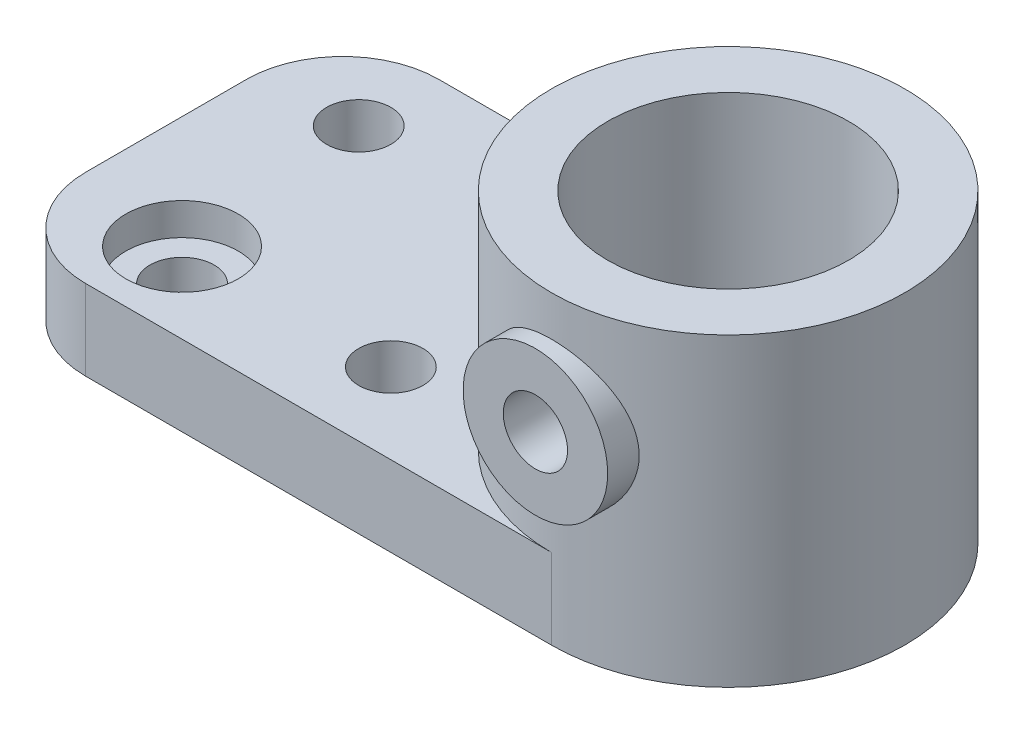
from build123d import *

# Parameters (mm, degrees)
SKETCH_1_R           = 7
SKETCH_1_R_2         = 4
EXTRUDE_1_DEPTH      = 10
SKETCH_2_R           = 22
SKETCH_2_R_2         = 15
EXTRUDE_2_DEPTH      = 28
FILLET_1_R           = 12
SKETCH_3_R           = 7
CUT_EXTRUDE_1_DEPTH  = 4
EXTRUDE_3_REACH      = 93.978
EXTRUDE_3_END_RADIUS = 22
SKETCH_4_R           = 9
SKETCH_5_R           = 4
CUT_EXTRUDE_2_DEPTH  = 13


with BuildPart() as part:
    # Sketch 1 → Extrude 1 (new body)
    with BuildSketch(Plane(origin=(0, 0, 0), x_dir=(1, 0, 0), z_dir=(0, 1, 0))):
        with BuildLine():
            Line((0, 22), (-70, 22))
            Line((-70, 22), (-70, -22))
            Line((-70, -22), (0, -22))
            ThreePointArc((0, -22), (22, 0), (0, 22))
        make_face()
        with Locations(Location((0, 0, 0), (0, 0, 270))):
            Circle(SKETCH_1_R, mode=Mode.SUBTRACT)
        with Locations(Location((-58, 12, 0), (0, 0, 270))):
            Circle(SKETCH_1_R_2, mode=Mode.SUBTRACT)
        with Locations(Location((-32, 12, 0), (0, 0, 270))):
            Circle(SKETCH_1_R_2, mode=Mode.SUBTRACT)
        with Locations(Location((-56, -12, 0), (0, 0, 270))):
            Circle(SKETCH_1_R_2, mode=Mode.SUBTRACT)
        with Locations(Location((-30, -12, 0), (0, 0, 270))):
            Circle(SKETCH_1_R_2, mode=Mode.SUBTRACT)
    extrude(amount=EXTRUDE_1_DEPTH)

    # Sketch 2 → Extrude 2 (add)
    with BuildSketch(Plane(origin=(0, 10, 0), x_dir=(1, 0, 0), z_dir=(0, 1, 0))):
        with Locations(Location((0, 0, 0), (0, 0, 270))):
            Circle(SKETCH_2_R)
        with Locations(Location((0, 0, 0), (0, 0, 270))):
            Circle(SKETCH_2_R_2, mode=Mode.SUBTRACT)
    extrude(amount=EXTRUDE_2_DEPTH)

    # Fillet 1
    fillet_1_edges = [part.edges().sort_by_distance(p)[0] for p in [
        (-70, 5, -22),
        (-70, 5, 22),
    ]]
    fillet(fillet_1_edges, radius=FILLET_1_R)

    # Sketch 3 → Cut-Extrude 1 (cut)
    with BuildSketch(Plane(origin=(0, 10, 0), x_dir=(1, 0, 0), z_dir=(0, 1, 0))):
        with Locations(Location((-56, -12, 0), (0, 0, 270))):
            Circle(SKETCH_3_R)
        with Locations(Location((-32, 12, 0), (0, 0, 270))):
            Circle(SKETCH_3_R)
    extrude(amount=-CUT_EXTRUDE_1_DEPTH, mode=Mode.SUBTRACT)

    # Extrude 3: up to this cylinder (the profile starts outside it)
    extrude_3_end = Plane(origin=(0, 24, 0), z_dir=(0, -1, 0)) * Cylinder(EXTRUDE_3_END_RADIUS, 232.956, mode=Mode.PRIVATE)
    # Sketch 4 → Extrude 3 (add, up to the surface)
    with BuildSketch(Plane.XY.offset(24), mode=Mode.PRIVATE) as extrude_3_sk1:
        with Locations((0, 24)):
            Circle(SKETCH_4_R)
    extrude_3_tool1 = extrude(extrude_3_sk1.sketch, amount=-EXTRUDE_3_REACH, mode=Mode.PRIVATE) - extrude_3_end
    add(extrude_3_tool1.solids().sort_by_distance((0, 24, 24))[0])

    # Sketch 5 → Cut-Extrude 2 (cut)
    with BuildSketch(Plane.XY.offset(24)):
        with Locations((0, 24)):
            Circle(SKETCH_5_R)
    extrude(amount=-CUT_EXTRUDE_2_DEPTH, mode=Mode.SUBTRACT)


solid = part.part
